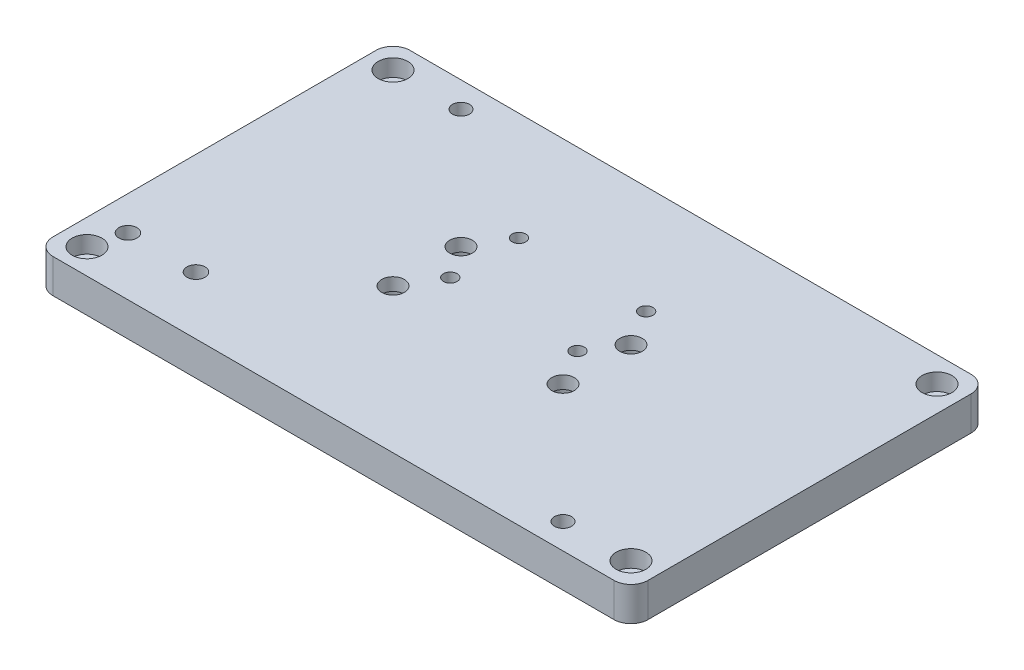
from build123d import *

# Parameters (mm, degrees)
SKETCH1_W                                         = 222.25
SKETCH1_H                                         = 133.35
BOSS_EXTRUDE1_DEPTH                               = 12.7
CBORE_FOR_5_16_SOCKET_HEAD_CAP_SCREW1_D           = 8.4328
CBORE_FOR_5_16_SOCKET_HEAD_CAP_SCREW1_CBORE_D     = 13.49502
CBORE_FOR_5_16_SOCKET_HEAD_CAP_SCREW1_CBORE_DEPTH = 7.9375
CBORE_FOR_1_4_SOCKET_HEAD_CAP_SCREW1_D            = 6.7564
CBORE_FOR_1_4_SOCKET_HEAD_CAP_SCREW1_CBORE_D      = 11.1125
CBORE_FOR_1_4_SOCKET_HEAD_CAP_SCREW1_CBORE_DEPTH  = 6.35
F_1_4_0_2500_DOWEL_HOLE1_D                        = 6.35
CBORE_FOR_10_SOCKET_HEAD_CAP_SCREW1_D             = 5.1054
CBORE_FOR_10_SOCKET_HEAD_CAP_SCREW1_CBORE_D       = 9.525
CBORE_FOR_10_SOCKET_HEAD_CAP_SCREW1_CBORE_DEPTH   = 4.826
CBORE_FOR_1_4_SOCKET_HEAD_CAP_SCREW3_D            = 6.7564
CBORE_FOR_1_4_SOCKET_HEAD_CAP_SCREW3_CBORE_D      = 11.1125
CBORE_FOR_1_4_SOCKET_HEAD_CAP_SCREW3_CBORE_DEPTH  = 6.35
FILLET1_R                                         = 6.35


with BuildPart() as part:
    # Sketch1 → Boss-Extrude1 (new body)
    with BuildSketch(Plane(origin=(0, 0, 0), x_dir=(1, 0, 0), z_dir=(0, 1, 0))):
        Rectangle(SKETCH1_W, SKETCH1_H)
    extrude(amount=BOSS_EXTRUDE1_DEPTH)

    # CBORE for 5_16 Socket Head Cap Screw1 (through all)
    with Locations(Plane.XZ):
        with Locations((31.75, -12.7), (-31.75, -12.7), (-31.75, 12.7), (31.75, 12.7)):
            CounterBoreHole(CBORE_FOR_5_16_SOCKET_HEAD_CAP_SCREW1_D / 2, CBORE_FOR_5_16_SOCKET_HEAD_CAP_SCREW1_CBORE_D / 2, CBORE_FOR_5_16_SOCKET_HEAD_CAP_SCREW1_CBORE_DEPTH)

    # CBORE for 1_4 Socket Head Cap Screw1 (through all)
    with Locations(Plane(origin=(0, 12.7, 0), x_dir=(1, 0, 0), z_dir=(0, 1, 0))):
        with Locations((101.6, -57.15), (101.6, 57.15), (-101.6, -57.15), (-101.6, 57.15)):
            CounterBoreHole(CBORE_FOR_1_4_SOCKET_HEAD_CAP_SCREW1_D / 2, CBORE_FOR_1_4_SOCKET_HEAD_CAP_SCREW1_CBORE_D / 2, CBORE_FOR_1_4_SOCKET_HEAD_CAP_SCREW1_CBORE_DEPTH)

    # 1_4 _0.2500_ Dowel Hole1 (through all)
    with Locations(Plane(origin=(0, 12.7, 0), x_dir=(1, 0, 0), z_dir=(0, 1, 0))):
        with Locations((76.2, -57.15), (-76.2, 57.15)):
            Hole(F_1_4_0_2500_DOWEL_HOLE1_D / 2)

    # CBORE for _10 Socket Head Cap Screw1 (through all)
    with Locations(Plane(origin=(0, 0, 0), x_dir=(-1, 0, 0), z_dir=(0, -1, 0))):
        with Locations((-23.749, 26.3477375), (-23.749, 0.6937375), (23.749, 26.3477375), (23.749, 0.6937375)):
            CounterBoreHole(CBORE_FOR_10_SOCKET_HEAD_CAP_SCREW1_D / 2, CBORE_FOR_10_SOCKET_HEAD_CAP_SCREW1_CBORE_D / 2, CBORE_FOR_10_SOCKET_HEAD_CAP_SCREW1_CBORE_DEPTH)

    # CBORE for 1_4 Socket Head Cap Screw3 (through all)
    with Locations(Plane(origin=(0, 0, 0), x_dir=(-1, 0, 0), z_dir=(0, -1, 0))):
        with Locations((73.025, -45.025), (98.425, -45.025)):
            CounterBoreHole(CBORE_FOR_1_4_SOCKET_HEAD_CAP_SCREW3_D / 2, CBORE_FOR_1_4_SOCKET_HEAD_CAP_SCREW3_CBORE_D / 2, CBORE_FOR_1_4_SOCKET_HEAD_CAP_SCREW3_CBORE_DEPTH)

    # Fillet1
    fillet1_edges = [part.edges().sort_by_distance(p)[0] for p in [
        (111.125, 6.35, 66.675),
        (-111.125, 6.35, 66.675),
        (-111.125, 6.35, -66.675),
        (111.125, 6.35, -66.675),
    ]]
    fillet(fillet1_edges, radius=FILLET1_R)


solid = part.part
